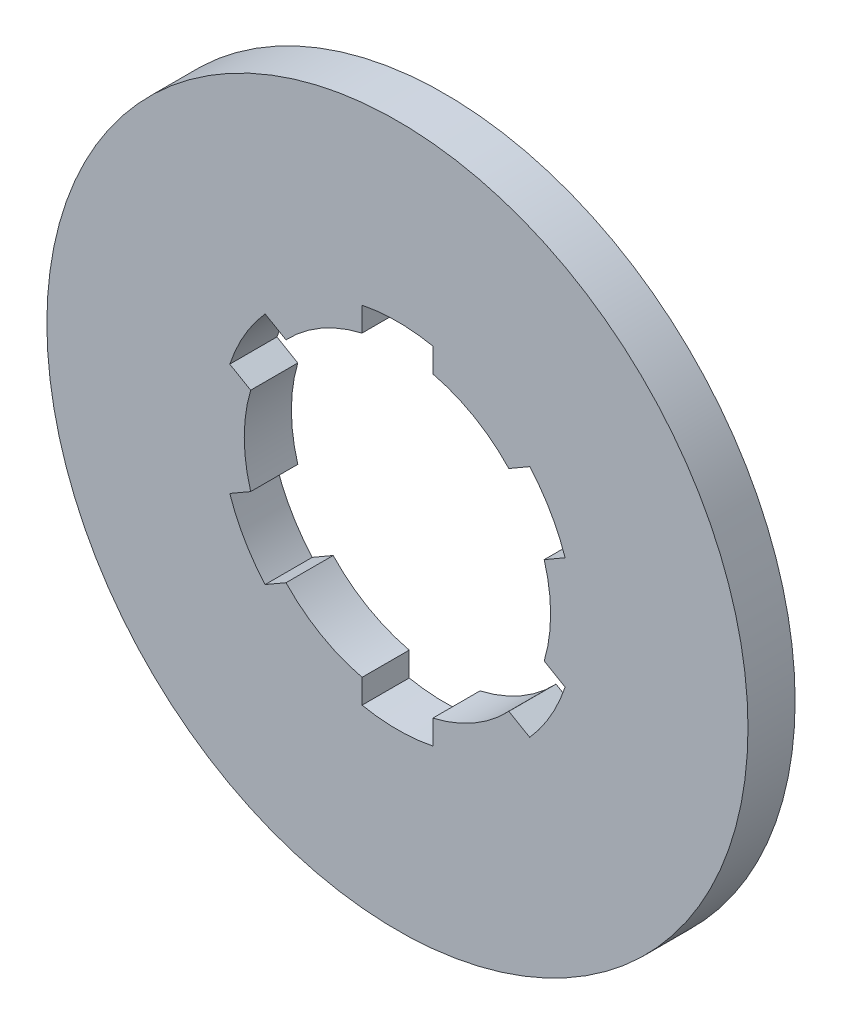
ISO-10303-21;
HEADER;
FILE_DESCRIPTION(('STEP AP214'),'2;1');
FILE_NAME('part.step','',(''),(''),'','','');
FILE_SCHEMA(('AUTOMOTIVE_DESIGN { 1 0 10303 214 1 1 1 1 }'));
ENDSEC;
DATA;
#1=APPLICATION_CONTEXT('core data for automotive mechanical design processes');
#2=APPLICATION_PROTOCOL_DEFINITION('international standard','automotive_design',2000,#1);
#3=PRODUCT_CONTEXT('',#1,'mechanical');
#4=PRODUCT('Part','Part','',(#3));
#5=PRODUCT_RELATED_PRODUCT_CATEGORY('part','',(#4));
#6=PRODUCT_DEFINITION_FORMATION('','',#4);
#7=PRODUCT_DEFINITION_CONTEXT('part definition',#1,'design');
#8=PRODUCT_DEFINITION('design','',#6,#7);
#9=PRODUCT_DEFINITION_SHAPE('','',#8);
#10=(LENGTH_UNIT() NAMED_UNIT(*) SI_UNIT(.MILLI.,.METRE.));
#11=(NAMED_UNIT(*) PLANE_ANGLE_UNIT() SI_UNIT($,.RADIAN.));
#12=(NAMED_UNIT(*) SI_UNIT($,.STERADIAN.) SOLID_ANGLE_UNIT());
#13=UNCERTAINTY_MEASURE_WITH_UNIT(LENGTH_MEASURE(1.E-05),#10,'distance_accuracy_value','');
#14=(GEOMETRIC_REPRESENTATION_CONTEXT(3) GLOBAL_UNCERTAINTY_ASSIGNED_CONTEXT((#13)) GLOBAL_UNIT_ASSIGNED_CONTEXT((#10,
#11,#12)) REPRESENTATION_CONTEXT('',''));
#15=CARTESIAN_POINT('',(0.,0.,0.));
#16=DIRECTION('',(0.,0.,1.));
#17=DIRECTION('',(1.,0.,0.));
#18=AXIS2_PLACEMENT_3D('',#15,#16,#17);
#19=CARTESIAN_POINT('',(0.,0.,-2.));
#20=DIRECTION('',(0.,0.,1.));
#21=DIRECTION('',(1.,0.,0.));
#22=AXIS2_PLACEMENT_3D('',#19,#20,#21);
#23=CYLINDRICAL_SURFACE('',#22,13.);
#24=CARTESIAN_POINT('',(0.,0.,-2.));
#25=DIRECTION('',(0.,0.,1.));
#26=DIRECTION('',(1.,0.,0.));
#27=AXIS2_PLACEMENT_3D('',#24,#25,#26);
#28=CIRCLE('',#27,13.);
#29=CARTESIAN_POINT('',(9.45445115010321,8.92263153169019,-2.));
#30=VERTEX_POINT('',#29);
#31=CARTESIAN_POINT('',(3.,12.6491106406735,-2.));
#32=VERTEX_POINT('',#31);
#33=EDGE_CURVE('E234',#30,#32,#28,.T.);
#34=ORIENTED_EDGE('',*,*,#33,.F.);
#35=DIRECTION('',(0.,0.,1.));
#36=VECTOR('',#35,1.);
#37=CARTESIAN_POINT('',(9.45445115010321,8.92263153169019,-2.));
#38=LINE('',#37,#36);
#39=CARTESIAN_POINT('',(9.45445115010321,8.92263153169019,1.99999999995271));
#40=VERTEX_POINT('',#39);
#41=EDGE_CURVE('E337',#30,#40,#38,.T.);
#42=ORIENTED_EDGE('',*,*,#41,.T.);
#43=CARTESIAN_POINT('',(0.,0.,2.));
#44=DIRECTION('',(0.,0.,1.));
#45=DIRECTION('',(1.,0.,0.));
#46=AXIS2_PLACEMENT_3D('',#43,#44,#45);
#47=CIRCLE('',#46,13.);
#48=CARTESIAN_POINT('',(3.,12.6491106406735,1.99999999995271));
#49=VERTEX_POINT('',#48);
#50=EDGE_CURVE('E225',#40,#49,#47,.T.);
#51=ORIENTED_EDGE('',*,*,#50,.T.);
#52=DIRECTION('',(0.,0.,1.));
#53=VECTOR('',#52,1.);
#54=CARTESIAN_POINT('',(3.,12.6491106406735,-2.));
#55=LINE('',#54,#53);
#56=EDGE_CURVE('E236',#32,#49,#55,.T.);
#57=ORIENTED_EDGE('',*,*,#56,.F.);
#58=EDGE_LOOP('',(#34,#42,#51,#57));
#59=FACE_BOUND('',#58,.T.);
#60=ADVANCED_FACE('F36',(#59),#23,.F.);
#61=CARTESIAN_POINT('',(12.4544511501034,-3.72647910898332,1.99999999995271));
#62=VERTEX_POINT('',#61);
#63=CARTESIAN_POINT('',(12.4544511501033,3.72647910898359,1.99999999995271));
#64=VERTEX_POINT('',#63);
#65=EDGE_CURVE('E217',#62,#64,#47,.T.);
#66=ORIENTED_EDGE('',*,*,#65,.T.);
#67=DIRECTION('',(0.,0.,1.));
#68=VECTOR('',#67,1.);
#69=CARTESIAN_POINT('',(12.4544511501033,3.72647910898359,-2.));
#70=LINE('',#69,#68);
#71=CARTESIAN_POINT('',(12.4544511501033,3.72647910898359,-2.));
#72=VERTEX_POINT('',#71);
#73=EDGE_CURVE('E197',#72,#64,#70,.T.);
#74=ORIENTED_EDGE('',*,*,#73,.F.);
#75=CARTESIAN_POINT('',(12.4544511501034,-3.72647910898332,-2.));
#76=VERTEX_POINT('',#75);
#77=EDGE_CURVE('E380',#76,#72,#28,.T.);
#78=ORIENTED_EDGE('',*,*,#77,.F.);
#79=DIRECTION('',(0.,0.,1.));
#80=VECTOR('',#79,1.);
#81=CARTESIAN_POINT('',(12.4544511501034,-3.72647910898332,-2.));
#82=LINE('',#81,#80);
#83=EDGE_CURVE('E223',#76,#62,#82,.T.);
#84=ORIENTED_EDGE('',*,*,#83,.T.);
#85=EDGE_LOOP('',(#66,#74,#78,#84));
#86=FACE_BOUND('',#85,.T.);
#87=ADVANCED_FACE('F222',(#86),#23,.F.);
#88=CARTESIAN_POINT('',(3.00000000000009,-12.6491106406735,1.99999999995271));
#89=VERTEX_POINT('',#88);
#90=CARTESIAN_POINT('',(9.45445115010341,-8.92263153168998,1.99999999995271));
#91=VERTEX_POINT('',#90);
#92=EDGE_CURVE('E224',#89,#91,#47,.T.);
#93=ORIENTED_EDGE('',*,*,#92,.T.);
#94=DIRECTION('',(0.,0.,1.));
#95=VECTOR('',#94,1.);
#96=CARTESIAN_POINT('',(9.45445115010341,-8.92263153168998,-2.));
#97=LINE('',#96,#95);
#98=CARTESIAN_POINT('',(9.45445115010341,-8.92263153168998,-2.));
#99=VERTEX_POINT('',#98);
#100=EDGE_CURVE('E466',#99,#91,#97,.T.);
#101=ORIENTED_EDGE('',*,*,#100,.F.);
#102=CARTESIAN_POINT('',(3.00000000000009,-12.6491106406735,-2.));
#103=VERTEX_POINT('',#102);
#104=EDGE_CURVE('E381',#103,#99,#28,.T.);
#105=ORIENTED_EDGE('',*,*,#104,.F.);
#106=DIRECTION('',(0.,0.,1.));
#107=VECTOR('',#106,1.);
#108=CARTESIAN_POINT('',(3.00000000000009,-12.6491106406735,-2.));
#109=LINE('',#108,#107);
#110=EDGE_CURVE('E477',#103,#89,#109,.T.);
#111=ORIENTED_EDGE('',*,*,#110,.T.);
#112=EDGE_LOOP('',(#93,#101,#105,#111));
#113=FACE_BOUND('',#112,.T.);
#114=ADVANCED_FACE('F263',(#113),#23,.F.);
#115=CARTESIAN_POINT('',(-9.45445115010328,-8.92263153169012,1.99999999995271));
#116=VERTEX_POINT('',#115);
#117=CARTESIAN_POINT('',(-2.99999999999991,-12.6491106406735,1.99999999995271));
#118=VERTEX_POINT('',#117);
#119=EDGE_CURVE('E228',#116,#118,#47,.T.);
#120=ORIENTED_EDGE('',*,*,#119,.T.);
#121=DIRECTION('',(0.,0.,1.));
#122=VECTOR('',#121,1.);
#123=CARTESIAN_POINT('',(-2.99999999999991,-12.6491106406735,-2.));
#124=LINE('',#123,#122);
#125=CARTESIAN_POINT('',(-2.99999999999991,-12.6491106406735,-2.));
#126=VERTEX_POINT('',#125);
#127=EDGE_CURVE('E449',#126,#118,#124,.T.);
#128=ORIENTED_EDGE('',*,*,#127,.F.);
#129=CARTESIAN_POINT('',(-9.45445115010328,-8.92263153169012,-2.));
#130=VERTEX_POINT('',#129);
#131=EDGE_CURVE('E384',#130,#126,#28,.T.);
#132=ORIENTED_EDGE('',*,*,#131,.F.);
#133=DIRECTION('',(0.,0.,1.));
#134=VECTOR('',#133,1.);
#135=CARTESIAN_POINT('',(-9.45445115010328,-8.92263153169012,-2.));
#136=LINE('',#135,#134);
#137=EDGE_CURVE('E421',#130,#116,#136,.T.);
#138=ORIENTED_EDGE('',*,*,#137,.T.);
#139=EDGE_LOOP('',(#120,#128,#132,#138));
#140=FACE_BOUND('',#139,.T.);
#141=ADVANCED_FACE('F448',(#140),#23,.F.);
#142=CARTESIAN_POINT('',(-12.4544511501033,3.72647910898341,1.99999999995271));
#143=VERTEX_POINT('',#142);
#144=CARTESIAN_POINT('',(-12.4544511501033,-3.7264791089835,1.99999999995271));
#145=VERTEX_POINT('',#144);
#146=EDGE_CURVE('E235',#143,#145,#47,.T.);
#147=ORIENTED_EDGE('',*,*,#146,.T.);
#148=DIRECTION('',(0.,0.,1.));
#149=VECTOR('',#148,1.);
#150=CARTESIAN_POINT('',(-12.4544511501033,-3.7264791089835,-2.));
#151=LINE('',#150,#149);
#152=CARTESIAN_POINT('',(-12.4544511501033,-3.7264791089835,-2.));
#153=VERTEX_POINT('',#152);
#154=EDGE_CURVE('E405',#153,#145,#151,.T.);
#155=ORIENTED_EDGE('',*,*,#154,.F.);
#156=CARTESIAN_POINT('',(-12.4544511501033,3.72647910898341,-2.));
#157=VERTEX_POINT('',#156);
#158=EDGE_CURVE('E240',#157,#153,#28,.T.);
#159=ORIENTED_EDGE('',*,*,#158,.F.);
#160=DIRECTION('',(0.,0.,1.));
#161=VECTOR('',#160,1.);
#162=CARTESIAN_POINT('',(-12.4544511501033,3.72647910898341,-2.));
#163=LINE('',#162,#161);
#164=EDGE_CURVE('E353',#157,#143,#163,.T.);
#165=ORIENTED_EDGE('',*,*,#164,.T.);
#166=EDGE_LOOP('',(#147,#155,#159,#165));
#167=FACE_BOUND('',#166,.T.);
#168=ADVANCED_FACE('F257',(#167),#23,.F.);
#169=CARTESIAN_POINT('',(0.,0.,2.));
#170=DIRECTION('',(0.,0.,-1.));
#171=DIRECTION('',(-1.,0.,0.));
#172=AXIS2_PLACEMENT_3D('',#169,#170,#171);
#173=CYLINDRICAL_SURFACE('',#172,29.75);
#174=CARTESIAN_POINT('',(0.,0.,2.));
#175=DIRECTION('',(0.,0.,1.));
#176=DIRECTION('',(1.,0.,0.));
#177=AXIS2_PLACEMENT_3D('',#174,#175,#176);
#178=CIRCLE('',#177,29.75);
#179=CARTESIAN_POINT('',(29.75,0.,2.));
#180=VERTEX_POINT('',#179);
#181=EDGE_CURVE('E11',#180,#180,#178,.T.);
#182=ORIENTED_EDGE('',*,*,#181,.F.);
#183=EDGE_LOOP('',(#182));
#184=FACE_BOUND('',#183,.T.);
#185=CARTESIAN_POINT('',(0.,0.,-2.));
#186=DIRECTION('',(0.,0.,1.));
#187=DIRECTION('',(1.,0.,0.));
#188=AXIS2_PLACEMENT_3D('',#185,#186,#187);
#189=CIRCLE('',#188,29.75);
#190=CARTESIAN_POINT('',(29.75,0.,-2.));
#191=VERTEX_POINT('',#190);
#192=EDGE_CURVE('E44',#191,#191,#189,.T.);
#193=ORIENTED_EDGE('',*,*,#192,.T.);
#194=EDGE_LOOP('',(#193));
#195=FACE_BOUND('',#194,.T.);
#196=ADVANCED_FACE('F38',(#184,#195),#173,.T.);
#197=CARTESIAN_POINT('',(0.,0.,2.));
#198=DIRECTION('',(0.,0.,1.));
#199=DIRECTION('',(1.,0.,0.));
#200=AXIS2_PLACEMENT_3D('',#197,#198,#199);
#201=PLANE('',#200);
#202=DIRECTION('',(-0.866025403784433,-0.50000000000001,0.));
#203=VECTOR('',#202,1.);
#204=CARTESIAN_POINT('',(11.2279220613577,9.94654543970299,1.99999999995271));
#205=LINE('',#204,#203);
#206=CARTESIAN_POINT('',(11.2279220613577,9.94654543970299,1.99999999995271));
#207=VERTEX_POINT('',#206);
#208=EDGE_CURVE('E334',#207,#40,#205,.T.);
#209=ORIENTED_EDGE('',*,*,#208,.F.);
#210=CARTESIAN_POINT('',(0.,0.,1.99999999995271));
#211=DIRECTION('',(0.,0.,1.));
#212=DIRECTION('',(0.50000000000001,-0.866025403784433,0.));
#213=AXIS2_PLACEMENT_3D('',#210,#211,#212);
#214=CIRCLE('',#213,15.);
#215=CARTESIAN_POINT('',(14.2279220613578,4.75039301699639,1.99999999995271));
#216=VERTEX_POINT('',#215);
#217=EDGE_CURVE('E219',#216,#207,#214,.T.);
#218=ORIENTED_EDGE('',*,*,#217,.F.);
#219=DIRECTION('',(0.866025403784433,0.50000000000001,0.));
#220=VECTOR('',#219,1.);
#221=CARTESIAN_POINT('',(12.4544511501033,3.72647910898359,1.99999999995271));
#222=LINE('',#221,#220);
#223=EDGE_CURVE('E200',#64,#216,#222,.T.);
#224=ORIENTED_EDGE('',*,*,#223,.F.);
#225=ORIENTED_EDGE('',*,*,#65,.F.);
#226=DIRECTION('',(-0.866025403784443,0.499999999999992,0.));
#227=VECTOR('',#226,1.);
#228=CARTESIAN_POINT('',(14.2279220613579,-4.75039301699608,1.99999999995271));
#229=LINE('',#228,#227);
#230=CARTESIAN_POINT('',(14.2279220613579,-4.75039301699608,1.99999999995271));
#231=VERTEX_POINT('',#230);
#232=EDGE_CURVE('E504',#231,#62,#229,.T.);
#233=ORIENTED_EDGE('',*,*,#232,.F.);
#234=CARTESIAN_POINT('',(0.,0.,1.99999999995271));
#235=DIRECTION('',(0.,0.,1.));
#236=DIRECTION('',(-0.499999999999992,-0.866025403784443,0.));
#237=AXIS2_PLACEMENT_3D('',#234,#235,#236);
#238=CIRCLE('',#237,15.);
#239=CARTESIAN_POINT('',(11.2279220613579,-9.94654543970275,1.99999999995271));
#240=VERTEX_POINT('',#239);
#241=EDGE_CURVE('E502',#240,#231,#238,.T.);
#242=ORIENTED_EDGE('',*,*,#241,.F.);
#243=DIRECTION('',(0.866025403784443,-0.499999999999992,0.));
#244=VECTOR('',#243,1.);
#245=CARTESIAN_POINT('',(9.45445115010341,-8.92263153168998,1.99999999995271));
#246=LINE('',#245,#244);
#247=EDGE_CURVE('E344',#91,#240,#246,.T.);
#248=ORIENTED_EDGE('',*,*,#247,.F.);
#249=ORIENTED_EDGE('',*,*,#92,.F.);
#250=DIRECTION('',(0.,1.,0.));
#251=VECTOR('',#250,1.);
#252=CARTESIAN_POINT('',(3.00000000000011,-14.696938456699,1.99999999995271));
#253=LINE('',#252,#251);
#254=CARTESIAN_POINT('',(3.00000000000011,-14.696938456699,1.99999999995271));
#255=VERTEX_POINT('',#254);
#256=EDGE_CURVE('E461',#255,#89,#253,.T.);
#257=ORIENTED_EDGE('',*,*,#256,.F.);
#258=CARTESIAN_POINT('',(0.,0.,1.99999999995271));
#259=DIRECTION('',(0.,0.,1.));
#260=DIRECTION('',(-1.,0.,0.));
#261=AXIS2_PLACEMENT_3D('',#258,#259,#260);
#262=CIRCLE('',#261,15.);
#263=CARTESIAN_POINT('',(-2.9999999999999,-14.6969384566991,1.99999999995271));
#264=VERTEX_POINT('',#263);
#265=EDGE_CURVE('E458',#264,#255,#262,.T.);
#266=ORIENTED_EDGE('',*,*,#265,.F.);
#267=DIRECTION('',(0.,-1.,0.));
#268=VECTOR('',#267,1.);
#269=CARTESIAN_POINT('',(-2.99999999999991,-12.6491106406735,1.99999999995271));
#270=LINE('',#269,#268);
#271=EDGE_CURVE('E455',#118,#264,#270,.T.);
#272=ORIENTED_EDGE('',*,*,#271,.F.);
#273=ORIENTED_EDGE('',*,*,#119,.F.);
#274=DIRECTION('',(0.866025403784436,0.500000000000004,0.));
#275=VECTOR('',#274,1.);
#276=CARTESIAN_POINT('',(-11.2279220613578,-9.94654543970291,1.99999999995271));
#277=LINE('',#276,#275);
#278=CARTESIAN_POINT('',(-11.2279220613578,-9.94654543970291,1.99999999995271));
#279=VERTEX_POINT('',#278);
#280=EDGE_CURVE('E452',#279,#116,#277,.T.);
#281=ORIENTED_EDGE('',*,*,#280,.F.);
#282=CARTESIAN_POINT('',(0.,0.,1.99999999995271));
#283=DIRECTION('',(0.,0.,1.));
#284=DIRECTION('',(-0.500000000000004,0.866025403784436,0.));
#285=AXIS2_PLACEMENT_3D('',#282,#283,#284);
#286=CIRCLE('',#285,15.);
#287=CARTESIAN_POINT('',(-14.2279220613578,-4.75039301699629,1.99999999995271));
#288=VERTEX_POINT('',#287);
#289=EDGE_CURVE('E486',#288,#279,#286,.T.);
#290=ORIENTED_EDGE('',*,*,#289,.F.);
#291=DIRECTION('',(-0.866025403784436,-0.500000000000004,0.));
#292=VECTOR('',#291,1.);
#293=CARTESIAN_POINT('',(-12.4544511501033,-3.7264791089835,1.99999999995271));
#294=LINE('',#293,#292);
#295=EDGE_CURVE('E442',#145,#288,#294,.T.);
#296=ORIENTED_EDGE('',*,*,#295,.F.);
#297=ORIENTED_EDGE('',*,*,#146,.F.);
#298=DIRECTION('',(0.86602540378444,-0.499999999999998,0.));
#299=VECTOR('',#298,1.);
#300=CARTESIAN_POINT('',(-14.2279220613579,4.75039301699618,1.99999999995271));
#301=LINE('',#300,#299);
#302=CARTESIAN_POINT('',(-14.2279220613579,4.75039301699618,1.99999999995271));
#303=VERTEX_POINT('',#302);
#304=EDGE_CURVE('E424',#303,#143,#301,.T.);
#305=ORIENTED_EDGE('',*,*,#304,.F.);
#306=CARTESIAN_POINT('',(0.,0.,1.99999999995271));
#307=DIRECTION('',(0.,0.,1.));
#308=DIRECTION('',(0.499999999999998,0.86602540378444,0.));
#309=AXIS2_PLACEMENT_3D('',#306,#307,#308);
#310=CIRCLE('',#309,15.);
#311=CARTESIAN_POINT('',(-11.2279220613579,9.94654543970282,1.99999999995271));
#312=VERTEX_POINT('',#311);
#313=EDGE_CURVE('E420',#312,#303,#310,.T.);
#314=ORIENTED_EDGE('',*,*,#313,.F.);
#315=DIRECTION('',(-0.86602540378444,0.499999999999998,0.));
#316=VECTOR('',#315,1.);
#317=CARTESIAN_POINT('',(-9.45445115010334,8.92263153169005,1.99999999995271));
#318=LINE('',#317,#316);
#319=CARTESIAN_POINT('',(-9.45445115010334,8.92263153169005,1.99999999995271));
#320=VERTEX_POINT('',#319);
#321=EDGE_CURVE('E417',#320,#312,#318,.T.);
#322=ORIENTED_EDGE('',*,*,#321,.F.);
#323=CARTESIAN_POINT('',(-3.,12.6491106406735,1.99999999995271));
#324=VERTEX_POINT('',#323);
#325=EDGE_CURVE('E230',#324,#320,#47,.T.);
#326=ORIENTED_EDGE('',*,*,#325,.F.);
#327=DIRECTION('',(0.,-1.,0.));
#328=VECTOR('',#327,1.);
#329=CARTESIAN_POINT('',(-3.,14.6969384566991,1.99999999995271));
#330=LINE('',#329,#328);
#331=CARTESIAN_POINT('',(-3.,14.6969384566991,1.99999999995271));
#332=VERTEX_POINT('',#331);
#333=EDGE_CURVE('E355',#332,#324,#330,.T.);
#334=ORIENTED_EDGE('',*,*,#333,.F.);
#335=CARTESIAN_POINT('',(0.,0.,1.99999999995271));
#336=DIRECTION('',(0.,0.,1.));
#337=DIRECTION('',(1.,0.,0.));
#338=AXIS2_PLACEMENT_3D('',#335,#336,#337);
#339=CIRCLE('',#338,15.);
#340=CARTESIAN_POINT('',(3.,14.6969384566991,1.99999999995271));
#341=VERTEX_POINT('',#340);
#342=EDGE_CURVE('E352',#341,#332,#339,.T.);
#343=ORIENTED_EDGE('',*,*,#342,.F.);
#344=DIRECTION('',(0.,1.,0.));
#345=VECTOR('',#344,1.);
#346=CARTESIAN_POINT('',(3.,12.6491106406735,1.99999999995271));
#347=LINE('',#346,#345);
#348=EDGE_CURVE('E349',#49,#341,#347,.T.);
#349=ORIENTED_EDGE('',*,*,#348,.F.);
#350=ORIENTED_EDGE('',*,*,#50,.F.);
#351=EDGE_LOOP('',(#209,#218,#224,#225,#233,#242,#248,#249,#257,#266,#272,#273,#281,#290,#296,
#297,#305,#314,#322,#326,#334,#343,#349,#350));
#352=FACE_BOUND('',#351,.T.);
#353=ORIENTED_EDGE('',*,*,#181,.T.);
#354=EDGE_LOOP('',(#353));
#355=FACE_BOUND('',#354,.T.);
#356=ADVANCED_FACE('F214',(#352,#355),#201,.T.);
#357=CARTESIAN_POINT('',(0.,0.,-2.));
#358=DIRECTION('',(0.,0.,1.));
#359=DIRECTION('',(1.,0.,0.));
#360=AXIS2_PLACEMENT_3D('',#357,#358,#359);
#361=PLANE('',#360);
#362=CARTESIAN_POINT('',(0.,0.,-2.));
#363=DIRECTION('',(0.,0.,1.));
#364=DIRECTION('',(0.50000000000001,-0.866025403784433,0.));
#365=AXIS2_PLACEMENT_3D('',#362,#363,#364);
#366=CIRCLE('',#365,15.);
#367=CARTESIAN_POINT('',(14.2279220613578,4.75039301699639,-2.));
#368=VERTEX_POINT('',#367);
#369=CARTESIAN_POINT('',(11.2279220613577,9.94654543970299,-2.));
#370=VERTEX_POINT('',#369);
#371=EDGE_CURVE('E51',#368,#370,#366,.T.);
#372=ORIENTED_EDGE('',*,*,#371,.T.);
#373=DIRECTION('',(-0.866025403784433,-0.50000000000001,0.));
#374=VECTOR('',#373,1.);
#375=CARTESIAN_POINT('',(11.2279220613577,9.94654543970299,-2.));
#376=LINE('',#375,#374);
#377=EDGE_CURVE('E209',#370,#30,#376,.T.);
#378=ORIENTED_EDGE('',*,*,#377,.T.);
#379=ORIENTED_EDGE('',*,*,#33,.T.);
#380=DIRECTION('',(0.,1.,0.));
#381=VECTOR('',#380,1.);
#382=CARTESIAN_POINT('',(3.,12.6491106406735,-2.));
#383=LINE('',#382,#381);
#384=CARTESIAN_POINT('',(3.,14.6969384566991,-2.));
#385=VERTEX_POINT('',#384);
#386=EDGE_CURVE('E365',#32,#385,#383,.T.);
#387=ORIENTED_EDGE('',*,*,#386,.T.);
#388=CARTESIAN_POINT('',(0.,0.,-2.));
#389=DIRECTION('',(0.,0.,1.));
#390=DIRECTION('',(1.,0.,0.));
#391=AXIS2_PLACEMENT_3D('',#388,#389,#390);
#392=CIRCLE('',#391,15.);
#393=CARTESIAN_POINT('',(-3.,14.6969384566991,-2.));
#394=VERTEX_POINT('',#393);
#395=EDGE_CURVE('E368',#385,#394,#392,.T.);
#396=ORIENTED_EDGE('',*,*,#395,.T.);
#397=DIRECTION('',(0.,-1.,0.));
#398=VECTOR('',#397,1.);
#399=CARTESIAN_POINT('',(-3.,14.6969384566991,-2.));
#400=LINE('',#399,#398);
#401=CARTESIAN_POINT('',(-3.,12.6491106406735,-2.));
#402=VERTEX_POINT('',#401);
#403=EDGE_CURVE('E371',#394,#402,#400,.T.);
#404=ORIENTED_EDGE('',*,*,#403,.T.);
#405=CARTESIAN_POINT('',(-9.45445115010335,8.92263153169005,-2.));
#406=VERTEX_POINT('',#405);
#407=EDGE_CURVE('E238',#402,#406,#28,.T.);
#408=ORIENTED_EDGE('',*,*,#407,.T.);
#409=DIRECTION('',(-0.86602540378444,0.499999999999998,0.));
#410=VECTOR('',#409,1.);
#411=CARTESIAN_POINT('',(-9.45445115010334,8.92263153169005,-2.));
#412=LINE('',#411,#410);
#413=CARTESIAN_POINT('',(-11.2279220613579,9.94654543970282,-2.));
#414=VERTEX_POINT('',#413);
#415=EDGE_CURVE('E426',#406,#414,#412,.T.);
#416=ORIENTED_EDGE('',*,*,#415,.T.);
#417=CARTESIAN_POINT('',(0.,0.,-2.));
#418=DIRECTION('',(0.,0.,1.));
#419=DIRECTION('',(0.499999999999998,0.86602540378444,0.));
#420=AXIS2_PLACEMENT_3D('',#417,#418,#419);
#421=CIRCLE('',#420,15.);
#422=CARTESIAN_POINT('',(-14.2279220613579,4.75039301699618,-2.));
#423=VERTEX_POINT('',#422);
#424=EDGE_CURVE('E429',#414,#423,#421,.T.);
#425=ORIENTED_EDGE('',*,*,#424,.T.);
#426=DIRECTION('',(0.86602540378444,-0.499999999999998,0.));
#427=VECTOR('',#426,1.);
#428=CARTESIAN_POINT('',(-14.2279220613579,4.75039301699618,-2.));
#429=LINE('',#428,#427);
#430=EDGE_CURVE('E400',#423,#157,#429,.T.);
#431=ORIENTED_EDGE('',*,*,#430,.T.);
#432=ORIENTED_EDGE('',*,*,#158,.T.);
#433=DIRECTION('',(-0.866025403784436,-0.500000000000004,0.));
#434=VECTOR('',#433,1.);
#435=CARTESIAN_POINT('',(-12.4544511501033,-3.7264791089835,-2.));
#436=LINE('',#435,#434);
#437=CARTESIAN_POINT('',(-14.2279220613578,-4.75039301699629,-2.));
#438=VERTEX_POINT('',#437);
#439=EDGE_CURVE('E397',#153,#438,#436,.T.);
#440=ORIENTED_EDGE('',*,*,#439,.T.);
#441=CARTESIAN_POINT('',(0.,0.,-2.));
#442=DIRECTION('',(0.,0.,1.));
#443=DIRECTION('',(-0.500000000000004,0.866025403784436,0.));
#444=AXIS2_PLACEMENT_3D('',#441,#442,#443);
#445=CIRCLE('',#444,15.);
#446=CARTESIAN_POINT('',(-11.2279220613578,-9.94654543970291,-2.));
#447=VERTEX_POINT('',#446);
#448=EDGE_CURVE('E413',#438,#447,#445,.T.);
#449=ORIENTED_EDGE('',*,*,#448,.T.);
#450=DIRECTION('',(0.866025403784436,0.500000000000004,0.));
#451=VECTOR('',#450,1.);
#452=CARTESIAN_POINT('',(-11.2279220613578,-9.94654543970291,-2.));
#453=LINE('',#452,#451);
#454=EDGE_CURVE('E409',#447,#130,#453,.T.);
#455=ORIENTED_EDGE('',*,*,#454,.T.);
#456=ORIENTED_EDGE('',*,*,#131,.T.);
#457=DIRECTION('',(0.,-1.,0.));
#458=VECTOR('',#457,1.);
#459=CARTESIAN_POINT('',(-2.99999999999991,-12.6491106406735,-2.));
#460=LINE('',#459,#458);
#461=CARTESIAN_POINT('',(-2.99999999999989,-14.6969384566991,-2.));
#462=VERTEX_POINT('',#461);
#463=EDGE_CURVE('E470',#126,#462,#460,.T.);
#464=ORIENTED_EDGE('',*,*,#463,.T.);
#465=CARTESIAN_POINT('',(0.,0.,-2.));
#466=DIRECTION('',(0.,0.,1.));
#467=DIRECTION('',(-1.,0.,0.));
#468=AXIS2_PLACEMENT_3D('',#465,#466,#467);
#469=CIRCLE('',#468,15.);
#470=CARTESIAN_POINT('',(3.00000000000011,-14.696938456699,-2.));
#471=VERTEX_POINT('',#470);
#472=EDGE_CURVE('E472',#462,#471,#469,.T.);
#473=ORIENTED_EDGE('',*,*,#472,.T.);
#474=DIRECTION('',(0.,1.,0.));
#475=VECTOR('',#474,1.);
#476=CARTESIAN_POINT('',(3.00000000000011,-14.696938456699,-2.));
#477=LINE('',#476,#475);
#478=EDGE_CURVE('E475',#471,#103,#477,.T.);
#479=ORIENTED_EDGE('',*,*,#478,.T.);
#480=ORIENTED_EDGE('',*,*,#104,.T.);
#481=DIRECTION('',(0.866025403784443,-0.499999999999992,0.));
#482=VECTOR('',#481,1.);
#483=CARTESIAN_POINT('',(9.45445115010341,-8.92263153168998,-2.));
#484=LINE('',#483,#482);
#485=CARTESIAN_POINT('',(11.2279220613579,-9.94654543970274,-2.));
#486=VERTEX_POINT('',#485);
#487=EDGE_CURVE('E509',#99,#486,#484,.T.);
#488=ORIENTED_EDGE('',*,*,#487,.T.);
#489=CARTESIAN_POINT('',(0.,0.,-2.));
#490=DIRECTION('',(0.,0.,1.));
#491=DIRECTION('',(-0.499999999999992,-0.866025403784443,0.));
#492=AXIS2_PLACEMENT_3D('',#489,#490,#491);
#493=CIRCLE('',#492,15.);
#494=CARTESIAN_POINT('',(14.2279220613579,-4.75039301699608,-2.));
#495=VERTEX_POINT('',#494);
#496=EDGE_CURVE('E59',#486,#495,#493,.T.);
#497=ORIENTED_EDGE('',*,*,#496,.T.);
#498=DIRECTION('',(-0.866025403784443,0.499999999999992,0.));
#499=VECTOR('',#498,1.);
#500=CARTESIAN_POINT('',(14.2279220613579,-4.75039301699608,-2.));
#501=LINE('',#500,#499);
#502=EDGE_CURVE('E512',#495,#76,#501,.T.);
#503=ORIENTED_EDGE('',*,*,#502,.T.);
#504=ORIENTED_EDGE('',*,*,#77,.T.);
#505=DIRECTION('',(0.866025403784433,0.50000000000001,0.));
#506=VECTOR('',#505,1.);
#507=CARTESIAN_POINT('',(12.4544511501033,3.72647910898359,-2.));
#508=LINE('',#507,#506);
#509=EDGE_CURVE('E203',#72,#368,#508,.T.);
#510=ORIENTED_EDGE('',*,*,#509,.T.);
#511=EDGE_LOOP('',(#372,#378,#379,#387,#396,#404,#408,#416,#425,#431,#432,#440,#449,#455,#456,
#464,#473,#479,#480,#488,#497,#503,#504,#510));
#512=FACE_BOUND('',#511,.T.);
#513=ORIENTED_EDGE('',*,*,#192,.F.);
#514=EDGE_LOOP('',(#513));
#515=FACE_BOUND('',#514,.T.);
#516=ADVANCED_FACE('F245',(#512,#515),#361,.F.);
#517=ORIENTED_EDGE('',*,*,#325,.T.);
#518=DIRECTION('',(0.,0.,1.));
#519=VECTOR('',#518,1.);
#520=CARTESIAN_POINT('',(-9.45445115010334,8.92263153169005,-2.));
#521=LINE('',#520,#519);
#522=EDGE_CURVE('E361',#406,#320,#521,.T.);
#523=ORIENTED_EDGE('',*,*,#522,.F.);
#524=ORIENTED_EDGE('',*,*,#407,.F.);
#525=DIRECTION('',(0.,0.,1.));
#526=VECTOR('',#525,1.);
#527=CARTESIAN_POINT('',(-3.,12.6491106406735,-2.));
#528=LINE('',#527,#526);
#529=EDGE_CURVE('E229',#402,#324,#528,.T.);
#530=ORIENTED_EDGE('',*,*,#529,.T.);
#531=EDGE_LOOP('',(#517,#523,#524,#530));
#532=FACE_BOUND('',#531,.T.);
#533=ADVANCED_FACE('F247',(#532),#23,.F.);
#534=CARTESIAN_POINT('',(-3.,14.6969384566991,-2.));
#535=DIRECTION('',(-1.,0.,0.));
#536=DIRECTION('',(0.,0.,1.));
#537=AXIS2_PLACEMENT_3D('',#534,#535,#536);
#538=PLANE('',#537);
#539=ORIENTED_EDGE('',*,*,#333,.T.);
#540=ORIENTED_EDGE('',*,*,#529,.F.);
#541=ORIENTED_EDGE('',*,*,#403,.F.);
#542=DIRECTION('',(0.,0.,1.));
#543=VECTOR('',#542,1.);
#544=CARTESIAN_POINT('',(-3.,14.6969384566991,-2.));
#545=LINE('',#544,#543);
#546=EDGE_CURVE('E376',#394,#332,#545,.T.);
#547=ORIENTED_EDGE('',*,*,#546,.T.);
#548=EDGE_LOOP('',(#539,#540,#541,#547));
#549=FACE_BOUND('',#548,.T.);
#550=ADVANCED_FACE('F254',(#549),#538,.F.);
#551=CARTESIAN_POINT('',(0.,0.,-2.));
#552=DIRECTION('',(0.,0.,1.));
#553=DIRECTION('',(1.,0.,0.));
#554=AXIS2_PLACEMENT_3D('',#551,#552,#553);
#555=CYLINDRICAL_SURFACE('',#554,15.);
#556=ORIENTED_EDGE('',*,*,#342,.T.);
#557=ORIENTED_EDGE('',*,*,#546,.F.);
#558=ORIENTED_EDGE('',*,*,#395,.F.);
#559=DIRECTION('',(0.,0.,1.));
#560=VECTOR('',#559,1.);
#561=CARTESIAN_POINT('',(3.,14.6969384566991,-2.));
#562=LINE('',#561,#560);
#563=EDGE_CURVE('E377',#385,#341,#562,.T.);
#564=ORIENTED_EDGE('',*,*,#563,.T.);
#565=EDGE_LOOP('',(#556,#557,#558,#564));
#566=FACE_BOUND('',#565,.T.);
#567=ADVANCED_FACE('F270',(#566),#555,.F.);
#568=CARTESIAN_POINT('',(3.,12.6491106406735,-2.));
#569=DIRECTION('',(1.,0.,0.));
#570=DIRECTION('',(0.,0.,-1.));
#571=AXIS2_PLACEMENT_3D('',#568,#569,#570);
#572=PLANE('',#571);
#573=ORIENTED_EDGE('',*,*,#348,.T.);
#574=ORIENTED_EDGE('',*,*,#563,.F.);
#575=ORIENTED_EDGE('',*,*,#386,.F.);
#576=ORIENTED_EDGE('',*,*,#56,.T.);
#577=EDGE_LOOP('',(#573,#574,#575,#576));
#578=FACE_BOUND('',#577,.T.);
#579=ADVANCED_FACE('F266',(#578),#572,.F.);
#580=CARTESIAN_POINT('',(-14.2279220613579,4.75039301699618,-2.));
#581=DIRECTION('',(-0.499999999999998,-0.86602540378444,0.));
#582=DIRECTION('',(0.86602540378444,-0.499999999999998,0.));
#583=AXIS2_PLACEMENT_3D('',#580,#581,#582);
#584=PLANE('',#583);
#585=ORIENTED_EDGE('',*,*,#304,.T.);
#586=ORIENTED_EDGE('',*,*,#164,.F.);
#587=ORIENTED_EDGE('',*,*,#430,.F.);
#588=DIRECTION('',(0.,0.,1.));
#589=VECTOR('',#588,1.);
#590=CARTESIAN_POINT('',(-14.2279220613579,4.75039301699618,-2.));
#591=LINE('',#590,#589);
#592=EDGE_CURVE('E358',#423,#303,#591,.T.);
#593=ORIENTED_EDGE('',*,*,#592,.T.);
#594=EDGE_LOOP('',(#585,#586,#587,#593));
#595=FACE_BOUND('',#594,.T.);
#596=ADVANCED_FACE('F269',(#595),#584,.F.);
#597=CARTESIAN_POINT('',(0.,0.,-2.));
#598=DIRECTION('',(0.,0.,1.));
#599=DIRECTION('',(1.,0.,0.));
#600=AXIS2_PLACEMENT_3D('',#597,#598,#599);
#601=CYLINDRICAL_SURFACE('',#600,15.);
#602=ORIENTED_EDGE('',*,*,#313,.T.);
#603=ORIENTED_EDGE('',*,*,#592,.F.);
#604=ORIENTED_EDGE('',*,*,#424,.F.);
#605=DIRECTION('',(0.,0.,1.));
#606=VECTOR('',#605,1.);
#607=CARTESIAN_POINT('',(-11.2279220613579,9.94654543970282,-2.));
#608=LINE('',#607,#606);
#609=EDGE_CURVE('E432',#414,#312,#608,.T.);
#610=ORIENTED_EDGE('',*,*,#609,.T.);
#611=EDGE_LOOP('',(#602,#603,#604,#610));
#612=FACE_BOUND('',#611,.T.);
#613=ADVANCED_FACE('F282',(#612),#601,.F.);
#614=CARTESIAN_POINT('',(-9.45445115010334,8.92263153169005,-2.));
#615=DIRECTION('',(0.499999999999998,0.86602540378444,0.));
#616=DIRECTION('',(-0.86602540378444,0.499999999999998,0.));
#617=AXIS2_PLACEMENT_3D('',#614,#615,#616);
#618=PLANE('',#617);
#619=ORIENTED_EDGE('',*,*,#321,.T.);
#620=ORIENTED_EDGE('',*,*,#609,.F.);
#621=ORIENTED_EDGE('',*,*,#415,.F.);
#622=ORIENTED_EDGE('',*,*,#522,.T.);
#623=EDGE_LOOP('',(#619,#620,#621,#622));
#624=FACE_BOUND('',#623,.T.);
#625=ADVANCED_FACE('F278',(#624),#618,.F.);
#626=CARTESIAN_POINT('',(-11.2279220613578,-9.94654543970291,-2.));
#627=DIRECTION('',(0.500000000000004,-0.866025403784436,0.));
#628=DIRECTION('',(0.866025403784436,0.500000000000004,0.));
#629=AXIS2_PLACEMENT_3D('',#626,#627,#628);
#630=PLANE('',#629);
#631=ORIENTED_EDGE('',*,*,#280,.T.);
#632=ORIENTED_EDGE('',*,*,#137,.F.);
#633=ORIENTED_EDGE('',*,*,#454,.F.);
#634=DIRECTION('',(0.,0.,1.));
#635=VECTOR('',#634,1.);
#636=CARTESIAN_POINT('',(-11.2279220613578,-9.94654543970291,-2.));
#637=LINE('',#636,#635);
#638=EDGE_CURVE('E411',#447,#279,#637,.T.);
#639=ORIENTED_EDGE('',*,*,#638,.T.);
#640=EDGE_LOOP('',(#631,#632,#633,#639));
#641=FACE_BOUND('',#640,.T.);
#642=ADVANCED_FACE('F281',(#641),#630,.F.);
#643=CARTESIAN_POINT('',(0.,0.,-2.));
#644=DIRECTION('',(0.,0.,1.));
#645=DIRECTION('',(1.,0.,0.));
#646=AXIS2_PLACEMENT_3D('',#643,#644,#645);
#647=CYLINDRICAL_SURFACE('',#646,15.);
#648=ORIENTED_EDGE('',*,*,#289,.T.);
#649=ORIENTED_EDGE('',*,*,#638,.F.);
#650=ORIENTED_EDGE('',*,*,#448,.F.);
#651=DIRECTION('',(0.,0.,1.));
#652=VECTOR('',#651,1.);
#653=CARTESIAN_POINT('',(-14.2279220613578,-4.75039301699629,-2.));
#654=LINE('',#653,#652);
#655=EDGE_CURVE('E408',#438,#288,#654,.T.);
#656=ORIENTED_EDGE('',*,*,#655,.T.);
#657=EDGE_LOOP('',(#648,#649,#650,#656));
#658=FACE_BOUND('',#657,.T.);
#659=ADVANCED_FACE('F294',(#658),#647,.F.);
#660=CARTESIAN_POINT('',(-12.4544511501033,-3.7264791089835,-2.));
#661=DIRECTION('',(-0.500000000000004,0.866025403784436,0.));
#662=DIRECTION('',(-0.866025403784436,-0.500000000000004,0.));
#663=AXIS2_PLACEMENT_3D('',#660,#661,#662);
#664=PLANE('',#663);
#665=ORIENTED_EDGE('',*,*,#295,.T.);
#666=ORIENTED_EDGE('',*,*,#655,.F.);
#667=ORIENTED_EDGE('',*,*,#439,.F.);
#668=ORIENTED_EDGE('',*,*,#154,.T.);
#669=EDGE_LOOP('',(#665,#666,#667,#668));
#670=FACE_BOUND('',#669,.T.);
#671=ADVANCED_FACE('F290',(#670),#664,.F.);
#672=CARTESIAN_POINT('',(3.00000000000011,-14.696938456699,-2.));
#673=DIRECTION('',(1.,0.,0.));
#674=DIRECTION('',(0.,1.,0.));
#675=AXIS2_PLACEMENT_3D('',#672,#673,#674);
#676=PLANE('',#675);
#677=ORIENTED_EDGE('',*,*,#256,.T.);
#678=ORIENTED_EDGE('',*,*,#110,.F.);
#679=ORIENTED_EDGE('',*,*,#478,.F.);
#680=DIRECTION('',(0.,0.,1.));
#681=VECTOR('',#680,1.);
#682=CARTESIAN_POINT('',(3.00000000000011,-14.696938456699,-2.));
#683=LINE('',#682,#681);
#684=EDGE_CURVE('E480',#471,#255,#683,.T.);
#685=ORIENTED_EDGE('',*,*,#684,.T.);
#686=EDGE_LOOP('',(#677,#678,#679,#685));
#687=FACE_BOUND('',#686,.T.);
#688=ADVANCED_FACE('F293',(#687),#676,.F.);
#689=CARTESIAN_POINT('',(0.,0.,-2.));
#690=DIRECTION('',(0.,0.,1.));
#691=DIRECTION('',(1.,0.,0.));
#692=AXIS2_PLACEMENT_3D('',#689,#690,#691);
#693=CYLINDRICAL_SURFACE('',#692,15.);
#694=ORIENTED_EDGE('',*,*,#265,.T.);
#695=ORIENTED_EDGE('',*,*,#684,.F.);
#696=ORIENTED_EDGE('',*,*,#472,.F.);
#697=DIRECTION('',(0.,0.,1.));
#698=VECTOR('',#697,1.);
#699=CARTESIAN_POINT('',(-2.9999999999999,-14.6969384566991,-2.));
#700=LINE('',#699,#698);
#701=EDGE_CURVE('E482',#462,#264,#700,.T.);
#702=ORIENTED_EDGE('',*,*,#701,.T.);
#703=EDGE_LOOP('',(#694,#695,#696,#702));
#704=FACE_BOUND('',#703,.T.);
#705=ADVANCED_FACE('F306',(#704),#693,.F.);
#706=CARTESIAN_POINT('',(-2.99999999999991,-12.6491106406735,-2.));
#707=DIRECTION('',(-1.,0.,0.));
#708=DIRECTION('',(0.,-1.,0.));
#709=AXIS2_PLACEMENT_3D('',#706,#707,#708);
#710=PLANE('',#709);
#711=ORIENTED_EDGE('',*,*,#271,.T.);
#712=ORIENTED_EDGE('',*,*,#701,.F.);
#713=ORIENTED_EDGE('',*,*,#463,.F.);
#714=ORIENTED_EDGE('',*,*,#127,.T.);
#715=EDGE_LOOP('',(#711,#712,#713,#714));
#716=FACE_BOUND('',#715,.T.);
#717=ADVANCED_FACE('F302',(#716),#710,.F.);
#718=CARTESIAN_POINT('',(14.2279220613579,-4.75039301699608,-2.));
#719=DIRECTION('',(0.499999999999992,0.866025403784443,0.));
#720=DIRECTION('',(-0.866025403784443,0.499999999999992,0.));
#721=AXIS2_PLACEMENT_3D('',#718,#719,#720);
#722=PLANE('',#721);
#723=ORIENTED_EDGE('',*,*,#232,.T.);
#724=ORIENTED_EDGE('',*,*,#83,.F.);
#725=ORIENTED_EDGE('',*,*,#502,.F.);
#726=DIRECTION('',(0.,0.,1.));
#727=VECTOR('',#726,1.);
#728=CARTESIAN_POINT('',(14.2279220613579,-4.75039301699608,-2.));
#729=LINE('',#728,#727);
#730=EDGE_CURVE('E463',#495,#231,#729,.T.);
#731=ORIENTED_EDGE('',*,*,#730,.T.);
#732=EDGE_LOOP('',(#723,#724,#725,#731));
#733=FACE_BOUND('',#732,.T.);
#734=ADVANCED_FACE('F305',(#733),#722,.F.);
#735=CARTESIAN_POINT('',(0.,0.,-2.));
#736=DIRECTION('',(0.,0.,1.));
#737=DIRECTION('',(1.,0.,0.));
#738=AXIS2_PLACEMENT_3D('',#735,#736,#737);
#739=CYLINDRICAL_SURFACE('',#738,15.);
#740=ORIENTED_EDGE('',*,*,#241,.T.);
#741=ORIENTED_EDGE('',*,*,#730,.F.);
#742=ORIENTED_EDGE('',*,*,#496,.F.);
#743=DIRECTION('',(0.,0.,1.));
#744=VECTOR('',#743,1.);
#745=CARTESIAN_POINT('',(11.2279220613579,-9.94654543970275,-2.));
#746=LINE('',#745,#744);
#747=EDGE_CURVE('E514',#486,#240,#746,.T.);
#748=ORIENTED_EDGE('',*,*,#747,.T.);
#749=EDGE_LOOP('',(#740,#741,#742,#748));
#750=FACE_BOUND('',#749,.T.);
#751=ADVANCED_FACE('F318',(#750),#739,.F.);
#752=CARTESIAN_POINT('',(9.45445115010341,-8.92263153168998,-2.));
#753=DIRECTION('',(-0.499999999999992,-0.866025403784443,0.));
#754=DIRECTION('',(0.866025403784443,-0.499999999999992,0.));
#755=AXIS2_PLACEMENT_3D('',#752,#753,#754);
#756=PLANE('',#755);
#757=ORIENTED_EDGE('',*,*,#247,.T.);
#758=ORIENTED_EDGE('',*,*,#747,.F.);
#759=ORIENTED_EDGE('',*,*,#487,.F.);
#760=ORIENTED_EDGE('',*,*,#100,.T.);
#761=EDGE_LOOP('',(#757,#758,#759,#760));
#762=FACE_BOUND('',#761,.T.);
#763=ADVANCED_FACE('F314',(#762),#756,.F.);
#764=CARTESIAN_POINT('',(11.2279220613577,9.94654543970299,-2.));
#765=DIRECTION('',(-0.50000000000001,0.866025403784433,0.));
#766=DIRECTION('',(-0.866025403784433,-0.50000000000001,0.));
#767=AXIS2_PLACEMENT_3D('',#764,#765,#766);
#768=PLANE('',#767);
#769=ORIENTED_EDGE('',*,*,#208,.T.);
#770=ORIENTED_EDGE('',*,*,#41,.F.);
#771=ORIENTED_EDGE('',*,*,#377,.F.);
#772=DIRECTION('',(0.,0.,1.));
#773=VECTOR('',#772,1.);
#774=CARTESIAN_POINT('',(11.2279220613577,9.94654543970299,-2.));
#775=LINE('',#774,#773);
#776=EDGE_CURVE('E339',#370,#207,#775,.T.);
#777=ORIENTED_EDGE('',*,*,#776,.T.);
#778=EDGE_LOOP('',(#769,#770,#771,#777));
#779=FACE_BOUND('',#778,.T.);
#780=ADVANCED_FACE('F317',(#779),#768,.F.);
#781=CARTESIAN_POINT('',(0.,0.,-2.));
#782=DIRECTION('',(0.,0.,1.));
#783=DIRECTION('',(1.,0.,0.));
#784=AXIS2_PLACEMENT_3D('',#781,#782,#783);
#785=CYLINDRICAL_SURFACE('',#784,15.);
#786=ORIENTED_EDGE('',*,*,#217,.T.);
#787=ORIENTED_EDGE('',*,*,#776,.F.);
#788=ORIENTED_EDGE('',*,*,#371,.F.);
#789=DIRECTION('',(0.,0.,1.));
#790=VECTOR('',#789,1.);
#791=CARTESIAN_POINT('',(14.2279220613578,4.75039301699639,-2.));
#792=LINE('',#791,#790);
#793=EDGE_CURVE('E208',#368,#216,#792,.T.);
#794=ORIENTED_EDGE('',*,*,#793,.T.);
#795=EDGE_LOOP('',(#786,#787,#788,#794));
#796=FACE_BOUND('',#795,.T.);
#797=ADVANCED_FACE('F327',(#796),#785,.F.);
#798=CARTESIAN_POINT('',(12.4544511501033,3.72647910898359,-2.));
#799=DIRECTION('',(0.50000000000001,-0.866025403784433,0.));
#800=DIRECTION('',(0.866025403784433,0.50000000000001,0.));
#801=AXIS2_PLACEMENT_3D('',#798,#799,#800);
#802=PLANE('',#801);
#803=ORIENTED_EDGE('',*,*,#223,.T.);
#804=ORIENTED_EDGE('',*,*,#793,.F.);
#805=ORIENTED_EDGE('',*,*,#509,.F.);
#806=ORIENTED_EDGE('',*,*,#73,.T.);
#807=EDGE_LOOP('',(#803,#804,#805,#806));
#808=FACE_BOUND('',#807,.T.);
#809=ADVANCED_FACE('F199',(#808),#802,.F.);
#810=CLOSED_SHELL('',(#60,#87,#114,#141,#168,#196,#356,#516,#533,#550,#567,#579,#596,#613,#625,
#642,#659,#671,#688,#705,#717,#734,#751,#763,#780,#797,#809));
#811=MANIFOLD_SOLID_BREP('B2',#810);
#812=ADVANCED_BREP_SHAPE_REPRESENTATION('',(#18,#811),#14);
#813=SHAPE_DEFINITION_REPRESENTATION(#9,#812);
ENDSEC;
END-ISO-10303-21;
